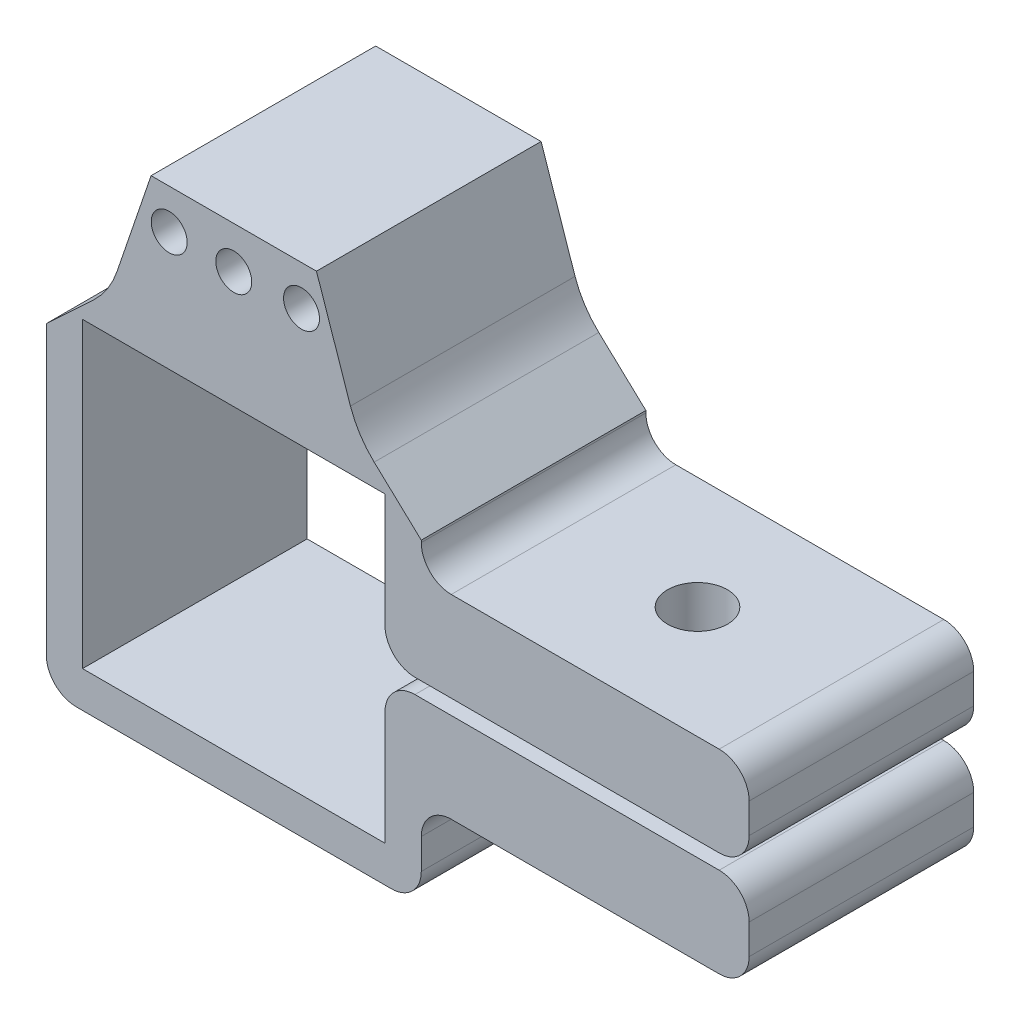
ISO-10303-21;
HEADER;
FILE_DESCRIPTION(('STEP AP214'),'2;1');
FILE_NAME('part.step','',(''),(''),'','','');
FILE_SCHEMA(('AUTOMOTIVE_DESIGN { 1 0 10303 214 1 1 1 1 }'));
ENDSEC;
DATA;
#1=APPLICATION_CONTEXT('core data for automotive mechanical design processes');
#2=APPLICATION_PROTOCOL_DEFINITION('international standard','automotive_design',2000,#1);
#3=PRODUCT_CONTEXT('',#1,'mechanical');
#4=PRODUCT('Part','Part','',(#3));
#5=PRODUCT_RELATED_PRODUCT_CATEGORY('part','',(#4));
#6=PRODUCT_DEFINITION_FORMATION('','',#4);
#7=PRODUCT_DEFINITION_CONTEXT('part definition',#1,'design');
#8=PRODUCT_DEFINITION('design','',#6,#7);
#9=PRODUCT_DEFINITION_SHAPE('','',#8);
#10=(LENGTH_UNIT() NAMED_UNIT(*) SI_UNIT(.MILLI.,.METRE.));
#11=(NAMED_UNIT(*) PLANE_ANGLE_UNIT() SI_UNIT($,.RADIAN.));
#12=(NAMED_UNIT(*) SI_UNIT($,.STERADIAN.) SOLID_ANGLE_UNIT());
#13=UNCERTAINTY_MEASURE_WITH_UNIT(LENGTH_MEASURE(1.E-05),#10,'distance_accuracy_value','');
#14=(GEOMETRIC_REPRESENTATION_CONTEXT(3) GLOBAL_UNCERTAINTY_ASSIGNED_CONTEXT((#13)) GLOBAL_UNIT_ASSIGNED_CONTEXT((#10,
#11,#12)) REPRESENTATION_CONTEXT('',''));
#15=CARTESIAN_POINT('',(0.,0.,0.));
#16=DIRECTION('',(0.,0.,1.));
#17=DIRECTION('',(1.,0.,0.));
#18=AXIS2_PLACEMENT_3D('',#15,#16,#17);
#19=CARTESIAN_POINT('',(-215.242156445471,0.198580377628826,15.));
#20=DIRECTION('',(0.,0.,-1.));
#21=DIRECTION('',(-1.,0.,0.));
#22=AXIS2_PLACEMENT_3D('',#19,#20,#21);
#23=PLANE('',#22);
#24=CARTESIAN_POINT('',(-227.342156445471,20.6077748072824,15.));
#25=DIRECTION('',(0.,0.,1.));
#26=DIRECTION('',(1.,0.,0.));
#27=AXIS2_PLACEMENT_3D('',#24,#25,#26);
#28=CIRCLE('',#27,1.20000000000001);
#29=CARTESIAN_POINT('',(-226.142156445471,20.6077748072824,15.));
#30=VERTEX_POINT('',#29);
#31=EDGE_CURVE('E443',#30,#30,#28,.T.);
#32=ORIENTED_EDGE('',*,*,#31,.F.);
#33=EDGE_LOOP('',(#32));
#34=FACE_BOUND('',#33,.T.);
#35=DIRECTION('',(0.,1.,0.));
#36=VECTOR('',#35,1.);
#37=CARTESIAN_POINT('',(-214.820078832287,16.3958612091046,15.));
#38=LINE('',#37,#36);
#39=CARTESIAN_POINT('',(-214.820078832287,11.1985803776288,15.));
#40=VERTEX_POINT('',#39);
#41=CARTESIAN_POINT('',(-214.820078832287,11.3393773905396,15.));
#42=VERTEX_POINT('',#41);
#43=EDGE_CURVE('E399',#40,#42,#38,.T.);
#44=ORIENTED_EDGE('',*,*,#43,.T.);
#45=DIRECTION('',(0.730787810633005,-0.682604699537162,0.));
#46=VECTOR('',#45,1.);
#47=CARTESIAN_POINT('',(-214.820078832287,11.3393773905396,15.));
#48=LINE('',#47,#46);
#49=CARTESIAN_POINT('',(-217.965212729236,14.2771428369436,15.));
#50=VERTEX_POINT('',#49);
#51=EDGE_CURVE('E500',#50,#42,#48,.T.);
#52=ORIENTED_EDGE('',*,*,#51,.F.);
#53=CARTESIAN_POINT('',(-213.869584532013,18.6618697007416,15.));
#54=DIRECTION('',(0.,0.,1.));
#55=DIRECTION('',(-1.,0.,0.));
#56=AXIS2_PLACEMENT_3D('',#53,#54,#55);
#57=CIRCLE('',#56,6.);
#58=CARTESIAN_POINT('',(-219.549280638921,16.7276897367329,15.));
#59=VERTEX_POINT('',#58);
#60=EDGE_CURVE('E504',#59,#50,#57,.T.);
#61=ORIENTED_EDGE('',*,*,#60,.F.);
#62=DIRECTION('',(0.322363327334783,-0.946616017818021,0.));
#63=VECTOR('',#62,1.);
#64=CARTESIAN_POINT('',(-221.820078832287,23.3958612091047,15.));
#65=LINE('',#64,#63);
#66=CARTESIAN_POINT('',(-221.820078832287,23.3958612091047,15.));
#67=VERTEX_POINT('',#66);
#68=EDGE_CURVE('E507',#67,#59,#65,.T.);
#69=ORIENTED_EDGE('',*,*,#68,.F.);
#70=DIRECTION('',(-1.,0.,0.));
#71=VECTOR('',#70,1.);
#72=CARTESIAN_POINT('',(-232.86399037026,23.3958612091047,15.));
#73=LINE('',#72,#71);
#74=CARTESIAN_POINT('',(-232.86399037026,23.3958612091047,15.));
#75=VERTEX_POINT('',#74);
#76=EDGE_CURVE('E401',#67,#75,#73,.T.);
#77=ORIENTED_EDGE('',*,*,#76,.T.);
#78=DIRECTION('',(0.322363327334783,0.946616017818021,0.));
#79=VECTOR('',#78,1.);
#80=CARTESIAN_POINT('',(-232.86399037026,23.3958612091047,15.));
#81=LINE('',#80,#79);
#82=CARTESIAN_POINT('',(-235.134788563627,16.7276897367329,15.));
#83=VERTEX_POINT('',#82);
#84=EDGE_CURVE('E475',#83,#75,#81,.T.);
#85=ORIENTED_EDGE('',*,*,#84,.F.);
#86=CARTESIAN_POINT('',(-240.814484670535,18.6618697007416,15.));
#87=DIRECTION('',(0.,0.,1.));
#88=DIRECTION('',(1.,0.,0.));
#89=AXIS2_PLACEMENT_3D('',#86,#87,#88);
#90=CIRCLE('',#89,6.);
#91=CARTESIAN_POINT('',(-236.718856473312,14.2771428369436,15.));
#92=VERTEX_POINT('',#91);
#93=EDGE_CURVE('E478',#92,#83,#90,.T.);
#94=ORIENTED_EDGE('',*,*,#93,.F.);
#95=DIRECTION('',(0.730787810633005,0.682604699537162,0.));
#96=VECTOR('',#95,1.);
#97=CARTESIAN_POINT('',(-239.863990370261,11.3393773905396,15.));
#98=LINE('',#97,#96);
#99=CARTESIAN_POINT('',(-239.863990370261,11.3393773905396,15.));
#100=VERTEX_POINT('',#99);
#101=EDGE_CURVE('E481',#100,#92,#98,.T.);
#102=ORIENTED_EDGE('',*,*,#101,.F.);
#103=DIRECTION('',(0.,-1.,0.));
#104=VECTOR('',#103,1.);
#105=CARTESIAN_POINT('',(-239.863990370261,-7.82349589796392,15.));
#106=LINE('',#105,#104);
#107=CARTESIAN_POINT('',(-239.863990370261,-7.82349589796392,15.));
#108=VERTEX_POINT('',#107);
#109=EDGE_CURVE('E404',#100,#108,#106,.T.);
#110=ORIENTED_EDGE('',*,*,#109,.T.);
#111=CARTESIAN_POINT('',(-237.863990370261,-7.82349589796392,15.));
#112=DIRECTION('',(0.,0.,1.));
#113=DIRECTION('',(1.,0.,0.));
#114=AXIS2_PLACEMENT_3D('',#111,#112,#113);
#115=CIRCLE('',#114,2.);
#116=CARTESIAN_POINT('',(-237.863990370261,-9.82349589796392,15.));
#117=VERTEX_POINT('',#116);
#118=EDGE_CURVE('E406',#108,#117,#115,.T.);
#119=ORIENTED_EDGE('',*,*,#118,.T.);
#120=DIRECTION('',(1.,0.,0.));
#121=VECTOR('',#120,1.);
#122=CARTESIAN_POINT('',(-216.820078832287,-9.82349589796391,15.));
#123=LINE('',#122,#121);
#124=CARTESIAN_POINT('',(-216.820078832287,-9.82349589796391,15.));
#125=VERTEX_POINT('',#124);
#126=EDGE_CURVE('E408',#117,#125,#123,.T.);
#127=ORIENTED_EDGE('',*,*,#126,.T.);
#128=CARTESIAN_POINT('',(-216.820078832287,-7.82349589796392,15.));
#129=DIRECTION('',(0.,0.,1.));
#130=DIRECTION('',(1.,0.,0.));
#131=AXIS2_PLACEMENT_3D('',#128,#129,#130);
#132=CIRCLE('',#131,2.);
#133=CARTESIAN_POINT('',(-214.820078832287,-7.82349589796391,15.));
#134=VERTEX_POINT('',#133);
#135=EDGE_CURVE('E410',#125,#134,#132,.T.);
#136=ORIENTED_EDGE('',*,*,#135,.T.);
#137=DIRECTION('',(0.,1.,0.));
#138=VECTOR('',#137,1.);
#139=CARTESIAN_POINT('',(-214.820078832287,-7.82349589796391,15.));
#140=LINE('',#139,#138);
#141=CARTESIAN_POINT('',(-214.820078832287,-5.80141962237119,15.));
#142=VERTEX_POINT('',#141);
#143=EDGE_CURVE('E412',#134,#142,#140,.T.);
#144=ORIENTED_EDGE('',*,*,#143,.T.);
#145=CARTESIAN_POINT('',(-212.820078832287,-5.80141962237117,15.));
#146=DIRECTION('',(0.,0.,-1.));
#147=DIRECTION('',(1.,0.,0.));
#148=AXIS2_PLACEMENT_3D('',#145,#146,#147);
#149=CIRCLE('',#148,2.);
#150=CARTESIAN_POINT('',(-212.820078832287,-3.80141962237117,15.));
#151=VERTEX_POINT('',#150);
#152=EDGE_CURVE('E414',#142,#151,#149,.T.);
#153=ORIENTED_EDGE('',*,*,#152,.T.);
#154=DIRECTION('',(1.,0.,0.));
#155=VECTOR('',#154,1.);
#156=CARTESIAN_POINT('',(-212.820078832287,-3.80141962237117,15.));
#157=LINE('',#156,#155);
#158=CARTESIAN_POINT('',(-194.92581591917,-3.80141962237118,15.));
#159=VERTEX_POINT('',#158);
#160=EDGE_CURVE('E416',#151,#159,#157,.T.);
#161=ORIENTED_EDGE('',*,*,#160,.T.);
#162=CARTESIAN_POINT('',(-194.92581591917,-1.80141962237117,15.));
#163=DIRECTION('',(0.,0.,1.));
#164=DIRECTION('',(1.,0.,0.));
#165=AXIS2_PLACEMENT_3D('',#162,#163,#164);
#166=CIRCLE('',#165,2.);
#167=CARTESIAN_POINT('',(-192.92581591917,-1.80141962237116,15.));
#168=VERTEX_POINT('',#167);
#169=EDGE_CURVE('E418',#159,#168,#166,.T.);
#170=ORIENTED_EDGE('',*,*,#169,.T.);
#171=DIRECTION('',(0.,1.,0.));
#172=VECTOR('',#171,1.);
#173=CARTESIAN_POINT('',(-192.92581591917,-1.80141962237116,15.));
#174=LINE('',#173,#172);
#175=CARTESIAN_POINT('',(-192.92581591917,0.198580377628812,15.));
#176=VERTEX_POINT('',#175);
#177=EDGE_CURVE('E420',#168,#176,#174,.T.);
#178=ORIENTED_EDGE('',*,*,#177,.T.);
#179=CARTESIAN_POINT('',(-194.92581591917,0.198580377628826,15.));
#180=DIRECTION('',(0.,0.,1.));
#181=DIRECTION('',(1.,0.,0.));
#182=AXIS2_PLACEMENT_3D('',#179,#180,#181);
#183=CIRCLE('',#182,2.);
#184=CARTESIAN_POINT('',(-194.92581591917,2.19858037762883,15.));
#185=VERTEX_POINT('',#184);
#186=EDGE_CURVE('E422',#176,#185,#183,.T.);
#187=ORIENTED_EDGE('',*,*,#186,.T.);
#188=DIRECTION('',(-1.,0.,0.));
#189=VECTOR('',#188,1.);
#190=CARTESIAN_POINT('',(-194.92581591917,2.19858037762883,15.));
#191=LINE('',#190,#189);
#192=CARTESIAN_POINT('',(-215.242156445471,2.19858037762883,15.));
#193=VERTEX_POINT('',#192);
#194=EDGE_CURVE('E220',#185,#193,#191,.T.);
#195=ORIENTED_EDGE('',*,*,#194,.T.);
#196=CARTESIAN_POINT('',(-215.242156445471,0.198580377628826,15.));
#197=DIRECTION('',(0.,0.,1.));
#198=DIRECTION('',(-1.,0.,0.));
#199=AXIS2_PLACEMENT_3D('',#196,#197,#198);
#200=CIRCLE('',#199,2.);
#201=CARTESIAN_POINT('',(-217.242156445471,0.198580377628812,15.));
#202=VERTEX_POINT('',#201);
#203=EDGE_CURVE('E212',#193,#202,#200,.T.);
#204=ORIENTED_EDGE('',*,*,#203,.T.);
#205=DIRECTION('',(0.,-1.,0.));
#206=VECTOR('',#205,1.);
#207=CARTESIAN_POINT('',(-217.242156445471,-7.40141962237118,15.));
#208=LINE('',#207,#206);
#209=CARTESIAN_POINT('',(-217.242156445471,-7.40141962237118,15.));
#210=VERTEX_POINT('',#209);
#211=EDGE_CURVE('E217',#202,#210,#208,.T.);
#212=ORIENTED_EDGE('',*,*,#211,.T.);
#213=DIRECTION('',(-1.,0.,0.));
#214=VECTOR('',#213,1.);
#215=CARTESIAN_POINT('',(-237.442156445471,-7.40141962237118,15.));
#216=LINE('',#215,#214);
#217=CARTESIAN_POINT('',(-237.442156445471,-7.40141962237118,15.));
#218=VERTEX_POINT('',#217);
#219=EDGE_CURVE('E56',#210,#218,#216,.T.);
#220=ORIENTED_EDGE('',*,*,#219,.T.);
#221=DIRECTION('',(0.,1.,0.));
#222=VECTOR('',#221,1.);
#223=CARTESIAN_POINT('',(-237.442156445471,12.7985803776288,15.));
#224=LINE('',#223,#222);
#225=CARTESIAN_POINT('',(-237.442156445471,12.7985803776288,15.));
#226=VERTEX_POINT('',#225);
#227=EDGE_CURVE('E295',#218,#226,#224,.T.);
#228=ORIENTED_EDGE('',*,*,#227,.T.);
#229=DIRECTION('',(1.,0.,0.));
#230=VECTOR('',#229,1.);
#231=CARTESIAN_POINT('',(-217.242156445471,12.7985803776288,15.));
#232=LINE('',#231,#230);
#233=CARTESIAN_POINT('',(-217.242156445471,12.7985803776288,15.));
#234=VERTEX_POINT('',#233);
#235=EDGE_CURVE('E148',#226,#234,#232,.T.);
#236=ORIENTED_EDGE('',*,*,#235,.T.);
#237=DIRECTION('',(0.,-1.,0.));
#238=VECTOR('',#237,1.);
#239=CARTESIAN_POINT('',(-217.242156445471,5.19858037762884,15.));
#240=LINE('',#239,#238);
#241=CARTESIAN_POINT('',(-217.242156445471,5.19858037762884,15.));
#242=VERTEX_POINT('',#241);
#243=EDGE_CURVE('E365',#234,#242,#240,.T.);
#244=ORIENTED_EDGE('',*,*,#243,.T.);
#245=CARTESIAN_POINT('',(-215.242156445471,5.19858037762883,15.));
#246=DIRECTION('',(0.,0.,1.));
#247=DIRECTION('',(-1.,0.,0.));
#248=AXIS2_PLACEMENT_3D('',#245,#246,#247);
#249=CIRCLE('',#248,2.);
#250=CARTESIAN_POINT('',(-215.242156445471,3.19858037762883,15.));
#251=VERTEX_POINT('',#250);
#252=EDGE_CURVE('E385',#242,#251,#249,.T.);
#253=ORIENTED_EDGE('',*,*,#252,.T.);
#254=DIRECTION('',(1.,0.,0.));
#255=VECTOR('',#254,1.);
#256=CARTESIAN_POINT('',(-194.92581591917,3.19858037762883,15.));
#257=LINE('',#256,#255);
#258=CARTESIAN_POINT('',(-194.92581591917,3.19858037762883,15.));
#259=VERTEX_POINT('',#258);
#260=EDGE_CURVE('E382',#251,#259,#257,.T.);
#261=ORIENTED_EDGE('',*,*,#260,.T.);
#262=CARTESIAN_POINT('',(-194.92581591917,5.19858037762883,15.));
#263=DIRECTION('',(0.,0.,1.));
#264=DIRECTION('',(-1.,0.,0.));
#265=AXIS2_PLACEMENT_3D('',#262,#263,#264);
#266=CIRCLE('',#265,2.);
#267=CARTESIAN_POINT('',(-192.92581591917,5.19858037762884,15.));
#268=VERTEX_POINT('',#267);
#269=EDGE_CURVE('E384',#259,#268,#266,.T.);
#270=ORIENTED_EDGE('',*,*,#269,.T.);
#271=DIRECTION('',(0.,1.,0.));
#272=VECTOR('',#271,1.);
#273=CARTESIAN_POINT('',(-192.92581591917,7.19858037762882,15.));
#274=LINE('',#273,#272);
#275=CARTESIAN_POINT('',(-192.92581591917,7.19858037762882,15.));
#276=VERTEX_POINT('',#275);
#277=EDGE_CURVE('E387',#268,#276,#274,.T.);
#278=ORIENTED_EDGE('',*,*,#277,.T.);
#279=CARTESIAN_POINT('',(-194.92581591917,7.19858037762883,15.));
#280=DIRECTION('',(0.,0.,1.));
#281=DIRECTION('',(-1.,0.,0.));
#282=AXIS2_PLACEMENT_3D('',#279,#280,#281);
#283=CIRCLE('',#282,2.);
#284=CARTESIAN_POINT('',(-194.92581591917,9.19858037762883,15.));
#285=VERTEX_POINT('',#284);
#286=EDGE_CURVE('E393',#276,#285,#283,.T.);
#287=ORIENTED_EDGE('',*,*,#286,.T.);
#288=DIRECTION('',(-1.,0.,0.));
#289=VECTOR('',#288,1.);
#290=CARTESIAN_POINT('',(-212.820078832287,9.19858037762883,15.));
#291=LINE('',#290,#289);
#292=CARTESIAN_POINT('',(-212.820078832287,9.19858037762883,15.));
#293=VERTEX_POINT('',#292);
#294=EDGE_CURVE('E395',#285,#293,#291,.T.);
#295=ORIENTED_EDGE('',*,*,#294,.T.);
#296=CARTESIAN_POINT('',(-212.820078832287,11.1985803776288,15.));
#297=DIRECTION('',(0.,0.,-1.));
#298=DIRECTION('',(-1.,0.,0.));
#299=AXIS2_PLACEMENT_3D('',#296,#297,#298);
#300=CIRCLE('',#299,2.);
#301=EDGE_CURVE('E397',#293,#40,#300,.T.);
#302=ORIENTED_EDGE('',*,*,#301,.T.);
#303=EDGE_LOOP('',(#44,#52,#61,#69,#77,#85,#94,#102,#110,#119,#127,#136,#144,#153,#161,#170,
#178,#187,#195,#204,#212,#220,#228,#236,#244,#253,#261,#270,#278,#287,#295,#302));
#304=FACE_BOUND('',#303,.T.);
#305=CARTESIAN_POINT('',(-231.654521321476,20.7423191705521,15.));
#306=DIRECTION('',(0.,0.,1.));
#307=DIRECTION('',(1.,0.,0.));
#308=AXIS2_PLACEMENT_3D('',#305,#306,#307);
#309=CIRCLE('',#308,1.20000000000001);
#310=CARTESIAN_POINT('',(-230.454521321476,20.7423191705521,15.));
#311=VERTEX_POINT('',#310);
#312=EDGE_CURVE('E245',#311,#311,#309,.T.);
#313=ORIENTED_EDGE('',*,*,#312,.F.);
#314=EDGE_LOOP('',(#313));
#315=FACE_BOUND('',#314,.T.);
#316=CARTESIAN_POINT('',(-222.817251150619,20.7423191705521,15.));
#317=DIRECTION('',(0.,0.,1.));
#318=DIRECTION('',(1.,0.,0.));
#319=AXIS2_PLACEMENT_3D('',#316,#317,#318);
#320=CIRCLE('',#319,1.20000000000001);
#321=CARTESIAN_POINT('',(-221.617251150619,20.7423191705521,15.));
#322=VERTEX_POINT('',#321);
#323=EDGE_CURVE('E449',#322,#322,#320,.T.);
#324=ORIENTED_EDGE('',*,*,#323,.F.);
#325=EDGE_LOOP('',(#324));
#326=FACE_BOUND('',#325,.T.);
#327=ADVANCED_FACE('F31',(#34,#304,#315,#326),#23,.F.);
#328=CARTESIAN_POINT('',(-215.242156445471,0.198580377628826,0.));
#329=DIRECTION('',(0.,0.,-1.));
#330=DIRECTION('',(-1.,0.,0.));
#331=AXIS2_PLACEMENT_3D('',#328,#329,#330);
#332=PLANE('',#331);
#333=DIRECTION('',(0.730787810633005,-0.682604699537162,0.));
#334=VECTOR('',#333,1.);
#335=CARTESIAN_POINT('',(-214.820078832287,11.3393773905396,0.));
#336=LINE('',#335,#334);
#337=CARTESIAN_POINT('',(-217.965212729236,14.2771428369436,0.));
#338=VERTEX_POINT('',#337);
#339=CARTESIAN_POINT('',(-214.820078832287,11.3393773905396,0.));
#340=VERTEX_POINT('',#339);
#341=EDGE_CURVE('E495',#338,#340,#336,.T.);
#342=ORIENTED_EDGE('',*,*,#341,.T.);
#343=DIRECTION('',(0.,1.,0.));
#344=VECTOR('',#343,1.);
#345=CARTESIAN_POINT('',(-214.820078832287,16.3958612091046,0.));
#346=LINE('',#345,#344);
#347=CARTESIAN_POINT('',(-214.820078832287,11.1985803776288,0.));
#348=VERTEX_POINT('',#347);
#349=EDGE_CURVE('E263',#348,#340,#346,.T.);
#350=ORIENTED_EDGE('',*,*,#349,.F.);
#351=CARTESIAN_POINT('',(-212.820078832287,11.1985803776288,0.));
#352=DIRECTION('',(0.,0.,-1.));
#353=DIRECTION('',(-1.,0.,0.));
#354=AXIS2_PLACEMENT_3D('',#351,#352,#353);
#355=CIRCLE('',#354,2.);
#356=CARTESIAN_POINT('',(-212.820078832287,9.19858037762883,0.));
#357=VERTEX_POINT('',#356);
#358=EDGE_CURVE('E261',#357,#348,#355,.T.);
#359=ORIENTED_EDGE('',*,*,#358,.F.);
#360=DIRECTION('',(-1.,0.,0.));
#361=VECTOR('',#360,1.);
#362=CARTESIAN_POINT('',(-212.820078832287,9.19858037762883,0.));
#363=LINE('',#362,#361);
#364=CARTESIAN_POINT('',(-194.92581591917,9.19858037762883,0.));
#365=VERTEX_POINT('',#364);
#366=EDGE_CURVE('E259',#365,#357,#363,.T.);
#367=ORIENTED_EDGE('',*,*,#366,.F.);
#368=CARTESIAN_POINT('',(-194.92581591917,7.19858037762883,0.));
#369=DIRECTION('',(0.,0.,1.));
#370=DIRECTION('',(-1.,0.,0.));
#371=AXIS2_PLACEMENT_3D('',#368,#369,#370);
#372=CIRCLE('',#371,2.);
#373=CARTESIAN_POINT('',(-192.92581591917,7.19858037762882,0.));
#374=VERTEX_POINT('',#373);
#375=EDGE_CURVE('E257',#374,#365,#372,.T.);
#376=ORIENTED_EDGE('',*,*,#375,.F.);
#377=DIRECTION('',(0.,1.,0.));
#378=VECTOR('',#377,1.);
#379=CARTESIAN_POINT('',(-192.92581591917,7.19858037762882,0.));
#380=LINE('',#379,#378);
#381=CARTESIAN_POINT('',(-192.92581591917,5.19858037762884,0.));
#382=VERTEX_POINT('',#381);
#383=EDGE_CURVE('E255',#382,#374,#380,.T.);
#384=ORIENTED_EDGE('',*,*,#383,.F.);
#385=CARTESIAN_POINT('',(-194.92581591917,5.19858037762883,0.));
#386=DIRECTION('',(0.,0.,1.));
#387=DIRECTION('',(-1.,0.,0.));
#388=AXIS2_PLACEMENT_3D('',#385,#386,#387);
#389=CIRCLE('',#388,2.);
#390=CARTESIAN_POINT('',(-194.92581591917,3.19858037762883,0.));
#391=VERTEX_POINT('',#390);
#392=EDGE_CURVE('E253',#391,#382,#389,.T.);
#393=ORIENTED_EDGE('',*,*,#392,.F.);
#394=DIRECTION('',(1.,0.,0.));
#395=VECTOR('',#394,1.);
#396=CARTESIAN_POINT('',(-194.92581591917,3.19858037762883,0.));
#397=LINE('',#396,#395);
#398=CARTESIAN_POINT('',(-215.242156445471,3.19858037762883,0.));
#399=VERTEX_POINT('',#398);
#400=EDGE_CURVE('E251',#399,#391,#397,.T.);
#401=ORIENTED_EDGE('',*,*,#400,.F.);
#402=CARTESIAN_POINT('',(-215.242156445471,5.19858037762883,0.));
#403=DIRECTION('',(0.,0.,1.));
#404=DIRECTION('',(-1.,0.,0.));
#405=AXIS2_PLACEMENT_3D('',#402,#403,#404);
#406=CIRCLE('',#405,2.);
#407=CARTESIAN_POINT('',(-217.242156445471,5.19858037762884,0.));
#408=VERTEX_POINT('',#407);
#409=EDGE_CURVE('E249',#408,#399,#406,.T.);
#410=ORIENTED_EDGE('',*,*,#409,.F.);
#411=DIRECTION('',(0.,-1.,0.));
#412=VECTOR('',#411,1.);
#413=CARTESIAN_POINT('',(-217.242156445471,5.19858037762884,0.));
#414=LINE('',#413,#412);
#415=CARTESIAN_POINT('',(-217.242156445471,12.7985803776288,0.));
#416=VERTEX_POINT('',#415);
#417=EDGE_CURVE('E247',#416,#408,#414,.T.);
#418=ORIENTED_EDGE('',*,*,#417,.F.);
#419=DIRECTION('',(1.,0.,0.));
#420=VECTOR('',#419,1.);
#421=CARTESIAN_POINT('',(-217.242156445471,12.7985803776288,0.));
#422=LINE('',#421,#420);
#423=CARTESIAN_POINT('',(-237.442156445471,12.7985803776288,0.));
#424=VERTEX_POINT('',#423);
#425=EDGE_CURVE('E244',#424,#416,#422,.T.);
#426=ORIENTED_EDGE('',*,*,#425,.F.);
#427=DIRECTION('',(0.,1.,0.));
#428=VECTOR('',#427,1.);
#429=CARTESIAN_POINT('',(-237.442156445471,12.7985803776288,0.));
#430=LINE('',#429,#428);
#431=CARTESIAN_POINT('',(-237.442156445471,-7.40141962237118,0.));
#432=VERTEX_POINT('',#431);
#433=EDGE_CURVE('E241',#432,#424,#430,.T.);
#434=ORIENTED_EDGE('',*,*,#433,.F.);
#435=DIRECTION('',(-1.,0.,0.));
#436=VECTOR('',#435,1.);
#437=CARTESIAN_POINT('',(-237.442156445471,-7.40141962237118,0.));
#438=LINE('',#437,#436);
#439=CARTESIAN_POINT('',(-217.242156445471,-7.40141962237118,0.));
#440=VERTEX_POINT('',#439);
#441=EDGE_CURVE('E140',#440,#432,#438,.T.);
#442=ORIENTED_EDGE('',*,*,#441,.F.);
#443=DIRECTION('',(0.,-1.,0.));
#444=VECTOR('',#443,1.);
#445=CARTESIAN_POINT('',(-217.242156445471,-7.40141962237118,0.));
#446=LINE('',#445,#444);
#447=CARTESIAN_POINT('',(-217.242156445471,0.198580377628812,0.));
#448=VERTEX_POINT('',#447);
#449=EDGE_CURVE('E292',#448,#440,#446,.T.);
#450=ORIENTED_EDGE('',*,*,#449,.F.);
#451=CARTESIAN_POINT('',(-215.242156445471,0.198580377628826,0.));
#452=DIRECTION('',(0.,0.,1.));
#453=DIRECTION('',(-1.,0.,0.));
#454=AXIS2_PLACEMENT_3D('',#451,#452,#453);
#455=CIRCLE('',#454,2.);
#456=CARTESIAN_POINT('',(-215.242156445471,2.19858037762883,0.));
#457=VERTEX_POINT('',#456);
#458=EDGE_CURVE('E229',#457,#448,#455,.T.);
#459=ORIENTED_EDGE('',*,*,#458,.F.);
#460=DIRECTION('',(-1.,0.,0.));
#461=VECTOR('',#460,1.);
#462=CARTESIAN_POINT('',(-194.92581591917,2.19858037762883,0.));
#463=LINE('',#462,#461);
#464=CARTESIAN_POINT('',(-194.92581591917,2.19858037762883,0.));
#465=VERTEX_POINT('',#464);
#466=EDGE_CURVE('E289',#465,#457,#463,.T.);
#467=ORIENTED_EDGE('',*,*,#466,.F.);
#468=CARTESIAN_POINT('',(-194.92581591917,0.198580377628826,0.));
#469=DIRECTION('',(0.,0.,1.));
#470=DIRECTION('',(1.,0.,0.));
#471=AXIS2_PLACEMENT_3D('',#468,#469,#470);
#472=CIRCLE('',#471,2.);
#473=CARTESIAN_POINT('',(-192.92581591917,0.198580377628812,0.));
#474=VERTEX_POINT('',#473);
#475=EDGE_CURVE('E287',#474,#465,#472,.T.);
#476=ORIENTED_EDGE('',*,*,#475,.F.);
#477=DIRECTION('',(0.,1.,0.));
#478=VECTOR('',#477,1.);
#479=CARTESIAN_POINT('',(-192.92581591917,-1.80141962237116,0.));
#480=LINE('',#479,#478);
#481=CARTESIAN_POINT('',(-192.92581591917,-1.80141962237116,0.));
#482=VERTEX_POINT('',#481);
#483=EDGE_CURVE('E285',#482,#474,#480,.T.);
#484=ORIENTED_EDGE('',*,*,#483,.F.);
#485=CARTESIAN_POINT('',(-194.92581591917,-1.80141962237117,0.));
#486=DIRECTION('',(0.,0.,1.));
#487=DIRECTION('',(1.,0.,0.));
#488=AXIS2_PLACEMENT_3D('',#485,#486,#487);
#489=CIRCLE('',#488,2.);
#490=CARTESIAN_POINT('',(-194.92581591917,-3.80141962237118,0.));
#491=VERTEX_POINT('',#490);
#492=EDGE_CURVE('E283',#491,#482,#489,.T.);
#493=ORIENTED_EDGE('',*,*,#492,.F.);
#494=DIRECTION('',(1.,0.,0.));
#495=VECTOR('',#494,1.);
#496=CARTESIAN_POINT('',(-212.820078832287,-3.80141962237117,0.));
#497=LINE('',#496,#495);
#498=CARTESIAN_POINT('',(-212.820078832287,-3.80141962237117,0.));
#499=VERTEX_POINT('',#498);
#500=EDGE_CURVE('E281',#499,#491,#497,.T.);
#501=ORIENTED_EDGE('',*,*,#500,.F.);
#502=CARTESIAN_POINT('',(-212.820078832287,-5.80141962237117,0.));
#503=DIRECTION('',(0.,0.,-1.));
#504=DIRECTION('',(1.,0.,0.));
#505=AXIS2_PLACEMENT_3D('',#502,#503,#504);
#506=CIRCLE('',#505,2.);
#507=CARTESIAN_POINT('',(-214.820078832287,-5.80141962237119,0.));
#508=VERTEX_POINT('',#507);
#509=EDGE_CURVE('E279',#508,#499,#506,.T.);
#510=ORIENTED_EDGE('',*,*,#509,.F.);
#511=DIRECTION('',(0.,1.,0.));
#512=VECTOR('',#511,1.);
#513=CARTESIAN_POINT('',(-214.820078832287,-7.82349589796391,0.));
#514=LINE('',#513,#512);
#515=CARTESIAN_POINT('',(-214.820078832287,-7.82349589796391,0.));
#516=VERTEX_POINT('',#515);
#517=EDGE_CURVE('E277',#516,#508,#514,.T.);
#518=ORIENTED_EDGE('',*,*,#517,.F.);
#519=CARTESIAN_POINT('',(-216.820078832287,-7.82349589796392,0.));
#520=DIRECTION('',(0.,0.,1.));
#521=DIRECTION('',(1.,0.,0.));
#522=AXIS2_PLACEMENT_3D('',#519,#520,#521);
#523=CIRCLE('',#522,2.);
#524=CARTESIAN_POINT('',(-216.820078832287,-9.82349589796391,0.));
#525=VERTEX_POINT('',#524);
#526=EDGE_CURVE('E275',#525,#516,#523,.T.);
#527=ORIENTED_EDGE('',*,*,#526,.F.);
#528=DIRECTION('',(1.,0.,0.));
#529=VECTOR('',#528,1.);
#530=CARTESIAN_POINT('',(-216.820078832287,-9.82349589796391,0.));
#531=LINE('',#530,#529);
#532=CARTESIAN_POINT('',(-237.863990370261,-9.82349589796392,0.));
#533=VERTEX_POINT('',#532);
#534=EDGE_CURVE('E273',#533,#525,#531,.T.);
#535=ORIENTED_EDGE('',*,*,#534,.F.);
#536=CARTESIAN_POINT('',(-237.863990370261,-7.82349589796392,0.));
#537=DIRECTION('',(0.,0.,1.));
#538=DIRECTION('',(1.,0.,0.));
#539=AXIS2_PLACEMENT_3D('',#536,#537,#538);
#540=CIRCLE('',#539,2.);
#541=CARTESIAN_POINT('',(-239.863990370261,-7.82349589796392,0.));
#542=VERTEX_POINT('',#541);
#543=EDGE_CURVE('E271',#542,#533,#540,.T.);
#544=ORIENTED_EDGE('',*,*,#543,.F.);
#545=DIRECTION('',(0.,-1.,0.));
#546=VECTOR('',#545,1.);
#547=CARTESIAN_POINT('',(-239.863990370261,-7.82349589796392,0.));
#548=LINE('',#547,#546);
#549=CARTESIAN_POINT('',(-239.863990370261,11.3393773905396,0.));
#550=VERTEX_POINT('',#549);
#551=EDGE_CURVE('E269',#550,#542,#548,.T.);
#552=ORIENTED_EDGE('',*,*,#551,.F.);
#553=DIRECTION('',(0.730787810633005,0.682604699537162,0.));
#554=VECTOR('',#553,1.);
#555=CARTESIAN_POINT('',(-239.863990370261,11.3393773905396,0.));
#556=LINE('',#555,#554);
#557=CARTESIAN_POINT('',(-236.718856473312,14.2771428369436,0.));
#558=VERTEX_POINT('',#557);
#559=EDGE_CURVE('E47',#550,#558,#556,.T.);
#560=ORIENTED_EDGE('',*,*,#559,.T.);
#561=CARTESIAN_POINT('',(-240.814484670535,18.6618697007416,0.));
#562=DIRECTION('',(0.,0.,1.));
#563=DIRECTION('',(1.,0.,0.));
#564=AXIS2_PLACEMENT_3D('',#561,#562,#563);
#565=CIRCLE('',#564,6.);
#566=CARTESIAN_POINT('',(-235.134788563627,16.7276897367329,0.));
#567=VERTEX_POINT('',#566);
#568=EDGE_CURVE('E487',#558,#567,#565,.T.);
#569=ORIENTED_EDGE('',*,*,#568,.T.);
#570=DIRECTION('',(0.322363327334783,0.946616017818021,0.));
#571=VECTOR('',#570,1.);
#572=CARTESIAN_POINT('',(-232.86399037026,23.3958612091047,0.));
#573=LINE('',#572,#571);
#574=CARTESIAN_POINT('',(-232.86399037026,23.3958612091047,0.));
#575=VERTEX_POINT('',#574);
#576=EDGE_CURVE('E470',#567,#575,#573,.T.);
#577=ORIENTED_EDGE('',*,*,#576,.T.);
#578=DIRECTION('',(-1.,0.,0.));
#579=VECTOR('',#578,1.);
#580=CARTESIAN_POINT('',(-232.86399037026,23.3958612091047,0.));
#581=LINE('',#580,#579);
#582=CARTESIAN_POINT('',(-221.820078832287,23.3958612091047,0.));
#583=VERTEX_POINT('',#582);
#584=EDGE_CURVE('E266',#583,#575,#581,.T.);
#585=ORIENTED_EDGE('',*,*,#584,.F.);
#586=DIRECTION('',(0.322363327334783,-0.946616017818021,0.));
#587=VECTOR('',#586,1.);
#588=CARTESIAN_POINT('',(-221.820078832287,23.3958612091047,0.));
#589=LINE('',#588,#587);
#590=CARTESIAN_POINT('',(-219.549280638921,16.7276897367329,0.));
#591=VERTEX_POINT('',#590);
#592=EDGE_CURVE('E503',#583,#591,#589,.T.);
#593=ORIENTED_EDGE('',*,*,#592,.T.);
#594=CARTESIAN_POINT('',(-213.869584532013,18.6618697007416,0.));
#595=DIRECTION('',(0.,0.,1.));
#596=DIRECTION('',(-1.,0.,0.));
#597=AXIS2_PLACEMENT_3D('',#594,#595,#596);
#598=CIRCLE('',#597,6.);
#599=EDGE_CURVE('E511',#591,#338,#598,.T.);
#600=ORIENTED_EDGE('',*,*,#599,.T.);
#601=EDGE_LOOP('',(#342,#350,#359,#367,#376,#384,#393,#401,#410,#418,#426,#434,#442,#450,#459,
#467,#476,#484,#493,#501,#510,#518,#527,#535,#544,#552,#560,#569,#577,#585,#593,#600));
#602=FACE_BOUND('',#601,.T.);
#603=CARTESIAN_POINT('',(-227.342156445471,20.6077748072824,0.));
#604=DIRECTION('',(0.,0.,1.));
#605=DIRECTION('',(1.,0.,0.));
#606=AXIS2_PLACEMENT_3D('',#603,#604,#605);
#607=CIRCLE('',#606,1.20000000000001);
#608=CARTESIAN_POINT('',(-226.142156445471,20.6077748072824,0.));
#609=VERTEX_POINT('',#608);
#610=EDGE_CURVE('E446',#609,#609,#607,.T.);
#611=ORIENTED_EDGE('',*,*,#610,.T.);
#612=EDGE_LOOP('',(#611));
#613=FACE_BOUND('',#612,.T.);
#614=CARTESIAN_POINT('',(-231.654521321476,20.7423191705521,0.));
#615=DIRECTION('',(0.,0.,1.));
#616=DIRECTION('',(1.,0.,0.));
#617=AXIS2_PLACEMENT_3D('',#614,#615,#616);
#618=CIRCLE('',#617,1.20000000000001);
#619=CARTESIAN_POINT('',(-230.454521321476,20.7423191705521,0.));
#620=VERTEX_POINT('',#619);
#621=EDGE_CURVE('E440',#620,#620,#618,.T.);
#622=ORIENTED_EDGE('',*,*,#621,.T.);
#623=EDGE_LOOP('',(#622));
#624=FACE_BOUND('',#623,.T.);
#625=CARTESIAN_POINT('',(-222.817251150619,20.7423191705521,0.));
#626=DIRECTION('',(0.,0.,1.));
#627=DIRECTION('',(1.,0.,0.));
#628=AXIS2_PLACEMENT_3D('',#625,#626,#627);
#629=CIRCLE('',#628,1.20000000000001);
#630=CARTESIAN_POINT('',(-221.617251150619,20.7423191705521,0.));
#631=VERTEX_POINT('',#630);
#632=EDGE_CURVE('E452',#631,#631,#629,.T.);
#633=ORIENTED_EDGE('',*,*,#632,.T.);
#634=EDGE_LOOP('',(#633));
#635=FACE_BOUND('',#634,.T.);
#636=ADVANCED_FACE('F369',(#602,#613,#624,#635),#332,.T.);
#637=CARTESIAN_POINT('',(-237.442156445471,12.7985803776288,15.));
#638=DIRECTION('',(-1.,0.,0.));
#639=DIRECTION('',(0.,0.,1.));
#640=AXIS2_PLACEMENT_3D('',#637,#638,#639);
#641=PLANE('',#640);
#642=ORIENTED_EDGE('',*,*,#433,.T.);
#643=DIRECTION('',(0.,0.,-1.));
#644=VECTOR('',#643,1.);
#645=CARTESIAN_POINT('',(-237.442156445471,12.7985803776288,15.));
#646=LINE('',#645,#644);
#647=EDGE_CURVE('E11',#226,#424,#646,.T.);
#648=ORIENTED_EDGE('',*,*,#647,.F.);
#649=ORIENTED_EDGE('',*,*,#227,.F.);
#650=DIRECTION('',(0.,0.,-1.));
#651=VECTOR('',#650,1.);
#652=CARTESIAN_POINT('',(-237.442156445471,-7.40141962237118,15.));
#653=LINE('',#652,#651);
#654=EDGE_CURVE('E237',#218,#432,#653,.T.);
#655=ORIENTED_EDGE('',*,*,#654,.T.);
#656=EDGE_LOOP('',(#642,#648,#649,#655));
#657=FACE_BOUND('',#656,.T.);
#658=ADVANCED_FACE('F33',(#657),#641,.F.);
#659=CARTESIAN_POINT('',(-217.242156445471,12.7985803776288,15.));
#660=DIRECTION('',(0.,1.,0.));
#661=DIRECTION('',(-1.,0.,0.));
#662=AXIS2_PLACEMENT_3D('',#659,#660,#661);
#663=PLANE('',#662);
#664=ORIENTED_EDGE('',*,*,#425,.T.);
#665=DIRECTION('',(0.,0.,-1.));
#666=VECTOR('',#665,1.);
#667=CARTESIAN_POINT('',(-217.242156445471,12.7985803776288,15.));
#668=LINE('',#667,#666);
#669=EDGE_CURVE('E40',#234,#416,#668,.T.);
#670=ORIENTED_EDGE('',*,*,#669,.F.);
#671=ORIENTED_EDGE('',*,*,#235,.F.);
#672=ORIENTED_EDGE('',*,*,#647,.T.);
#673=EDGE_LOOP('',(#664,#670,#671,#672));
#674=FACE_BOUND('',#673,.T.);
#675=ADVANCED_FACE('F910',(#674),#663,.F.);
#676=CARTESIAN_POINT('',(-217.242156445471,5.19858037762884,15.));
#677=DIRECTION('',(1.,0.,0.));
#678=DIRECTION('',(0.,0.,-1.));
#679=AXIS2_PLACEMENT_3D('',#676,#677,#678);
#680=PLANE('',#679);
#681=ORIENTED_EDGE('',*,*,#417,.T.);
#682=DIRECTION('',(0.,0.,-1.));
#683=VECTOR('',#682,1.);
#684=CARTESIAN_POINT('',(-217.242156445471,5.19858037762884,15.));
#685=LINE('',#684,#683);
#686=EDGE_CURVE('E356',#242,#408,#685,.T.);
#687=ORIENTED_EDGE('',*,*,#686,.F.);
#688=ORIENTED_EDGE('',*,*,#243,.F.);
#689=ORIENTED_EDGE('',*,*,#669,.T.);
#690=EDGE_LOOP('',(#681,#687,#688,#689));
#691=FACE_BOUND('',#690,.T.);
#692=ADVANCED_FACE('F363',(#691),#680,.F.);
#693=CARTESIAN_POINT('',(-215.242156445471,5.19858037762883,15.));
#694=DIRECTION('',(0.,0.,-1.));
#695=DIRECTION('',(-1.,0.,0.));
#696=AXIS2_PLACEMENT_3D('',#693,#694,#695);
#697=CYLINDRICAL_SURFACE('',#696,2.);
#698=ORIENTED_EDGE('',*,*,#409,.T.);
#699=DIRECTION('',(0.,0.,-1.));
#700=VECTOR('',#699,1.);
#701=CARTESIAN_POINT('',(-215.242156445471,3.19858037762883,15.));
#702=LINE('',#701,#700);
#703=EDGE_CURVE('E353',#251,#399,#702,.T.);
#704=ORIENTED_EDGE('',*,*,#703,.F.);
#705=ORIENTED_EDGE('',*,*,#252,.F.);
#706=ORIENTED_EDGE('',*,*,#686,.T.);
#707=EDGE_LOOP('',(#698,#704,#705,#706));
#708=FACE_BOUND('',#707,.T.);
#709=ADVANCED_FACE('F376',(#708),#697,.T.);
#710=CARTESIAN_POINT('',(-194.92581591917,3.19858037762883,15.));
#711=DIRECTION('',(0.,1.,0.));
#712=DIRECTION('',(0.,0.,1.));
#713=AXIS2_PLACEMENT_3D('',#710,#711,#712);
#714=PLANE('',#713);
#715=CARTESIAN_POINT('',(-203.872947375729,3.19858037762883,7.5));
#716=DIRECTION('',(0.,1.,0.));
#717=DIRECTION('',(0.,0.,1.));
#718=AXIS2_PLACEMENT_3D('',#715,#716,#717);
#719=CIRCLE('',#718,2.);
#720=CARTESIAN_POINT('',(-203.872947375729,3.19858037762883,9.5));
#721=VERTEX_POINT('',#720);
#722=EDGE_CURVE('E455',#721,#721,#719,.T.);
#723=ORIENTED_EDGE('',*,*,#722,.T.);
#724=EDGE_LOOP('',(#723));
#725=FACE_BOUND('',#724,.T.);
#726=ORIENTED_EDGE('',*,*,#400,.T.);
#727=DIRECTION('',(0.,0.,-1.));
#728=VECTOR('',#727,1.);
#729=CARTESIAN_POINT('',(-194.92581591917,3.19858037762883,15.));
#730=LINE('',#729,#728);
#731=EDGE_CURVE('E350',#259,#391,#730,.T.);
#732=ORIENTED_EDGE('',*,*,#731,.F.);
#733=ORIENTED_EDGE('',*,*,#260,.F.);
#734=ORIENTED_EDGE('',*,*,#703,.T.);
#735=EDGE_LOOP('',(#726,#732,#733,#734));
#736=FACE_BOUND('',#735,.T.);
#737=ADVANCED_FACE('F380',(#725,#736),#714,.F.);
#738=CARTESIAN_POINT('',(-194.92581591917,5.19858037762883,15.));
#739=DIRECTION('',(0.,0.,-1.));
#740=DIRECTION('',(-1.,0.,0.));
#741=AXIS2_PLACEMENT_3D('',#738,#739,#740);
#742=CYLINDRICAL_SURFACE('',#741,2.);
#743=ORIENTED_EDGE('',*,*,#392,.T.);
#744=DIRECTION('',(0.,0.,-1.));
#745=VECTOR('',#744,1.);
#746=CARTESIAN_POINT('',(-192.92581591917,5.19858037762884,15.));
#747=LINE('',#746,#745);
#748=EDGE_CURVE('E347',#268,#382,#747,.T.);
#749=ORIENTED_EDGE('',*,*,#748,.F.);
#750=ORIENTED_EDGE('',*,*,#269,.F.);
#751=ORIENTED_EDGE('',*,*,#731,.T.);
#752=EDGE_LOOP('',(#743,#749,#750,#751));
#753=FACE_BOUND('',#752,.T.);
#754=ADVANCED_FACE('F590',(#753),#742,.T.);
#755=CARTESIAN_POINT('',(-192.92581591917,7.19858037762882,15.));
#756=DIRECTION('',(-1.,0.,0.));
#757=DIRECTION('',(0.,0.,1.));
#758=AXIS2_PLACEMENT_3D('',#755,#756,#757);
#759=PLANE('',#758);
#760=ORIENTED_EDGE('',*,*,#383,.T.);
#761=DIRECTION('',(0.,0.,-1.));
#762=VECTOR('',#761,1.);
#763=CARTESIAN_POINT('',(-192.92581591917,7.19858037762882,15.));
#764=LINE('',#763,#762);
#765=EDGE_CURVE('E344',#276,#374,#764,.T.);
#766=ORIENTED_EDGE('',*,*,#765,.F.);
#767=ORIENTED_EDGE('',*,*,#277,.F.);
#768=ORIENTED_EDGE('',*,*,#748,.T.);
#769=EDGE_LOOP('',(#760,#766,#767,#768));
#770=FACE_BOUND('',#769,.T.);
#771=ADVANCED_FACE('F587',(#770),#759,.F.);
#772=CARTESIAN_POINT('',(-194.92581591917,7.19858037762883,15.));
#773=DIRECTION('',(0.,0.,-1.));
#774=DIRECTION('',(-1.,0.,0.));
#775=AXIS2_PLACEMENT_3D('',#772,#773,#774);
#776=CYLINDRICAL_SURFACE('',#775,2.);
#777=ORIENTED_EDGE('',*,*,#375,.T.);
#778=DIRECTION('',(0.,0.,-1.));
#779=VECTOR('',#778,1.);
#780=CARTESIAN_POINT('',(-194.92581591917,9.19858037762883,15.));
#781=LINE('',#780,#779);
#782=EDGE_CURVE('E341',#285,#365,#781,.T.);
#783=ORIENTED_EDGE('',*,*,#782,.F.);
#784=ORIENTED_EDGE('',*,*,#286,.F.);
#785=ORIENTED_EDGE('',*,*,#765,.T.);
#786=EDGE_LOOP('',(#777,#783,#784,#785));
#787=FACE_BOUND('',#786,.T.);
#788=ADVANCED_FACE('F583',(#787),#776,.T.);
#789=CARTESIAN_POINT('',(-212.820078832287,9.19858037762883,15.));
#790=DIRECTION('',(0.,-1.,0.));
#791=DIRECTION('',(0.,0.,-1.));
#792=AXIS2_PLACEMENT_3D('',#789,#790,#791);
#793=PLANE('',#792);
#794=CARTESIAN_POINT('',(-203.872947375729,9.19858037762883,7.5));
#795=DIRECTION('',(0.,1.,0.));
#796=DIRECTION('',(0.,0.,1.));
#797=AXIS2_PLACEMENT_3D('',#794,#795,#796);
#798=CIRCLE('',#797,2.);
#799=CARTESIAN_POINT('',(-203.872947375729,9.19858037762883,9.5));
#800=VERTEX_POINT('',#799);
#801=EDGE_CURVE('E463',#800,#800,#798,.T.);
#802=ORIENTED_EDGE('',*,*,#801,.F.);
#803=EDGE_LOOP('',(#802));
#804=FACE_BOUND('',#803,.T.);
#805=ORIENTED_EDGE('',*,*,#366,.T.);
#806=DIRECTION('',(0.,0.,-1.));
#807=VECTOR('',#806,1.);
#808=CARTESIAN_POINT('',(-212.820078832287,9.19858037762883,15.));
#809=LINE('',#808,#807);
#810=EDGE_CURVE('E338',#293,#357,#809,.T.);
#811=ORIENTED_EDGE('',*,*,#810,.F.);
#812=ORIENTED_EDGE('',*,*,#294,.F.);
#813=ORIENTED_EDGE('',*,*,#782,.T.);
#814=EDGE_LOOP('',(#805,#811,#812,#813));
#815=FACE_BOUND('',#814,.T.);
#816=ADVANCED_FACE('F578',(#804,#815),#793,.F.);
#817=CARTESIAN_POINT('',(-212.820078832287,11.1985803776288,15.));
#818=DIRECTION('',(0.,0.,-1.));
#819=DIRECTION('',(-1.,0.,0.));
#820=AXIS2_PLACEMENT_3D('',#817,#818,#819);
#821=CYLINDRICAL_SURFACE('',#820,2.);
#822=ORIENTED_EDGE('',*,*,#358,.T.);
#823=DIRECTION('',(0.,0.,-1.));
#824=VECTOR('',#823,1.);
#825=CARTESIAN_POINT('',(-214.820078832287,11.1985803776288,15.));
#826=LINE('',#825,#824);
#827=EDGE_CURVE('E335',#40,#348,#826,.T.);
#828=ORIENTED_EDGE('',*,*,#827,.F.);
#829=ORIENTED_EDGE('',*,*,#301,.F.);
#830=ORIENTED_EDGE('',*,*,#810,.T.);
#831=EDGE_LOOP('',(#822,#828,#829,#830));
#832=FACE_BOUND('',#831,.T.);
#833=ADVANCED_FACE('F572',(#832),#821,.F.);
#834=CARTESIAN_POINT('',(-214.820078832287,16.3958612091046,15.));
#835=DIRECTION('',(-1.,0.,0.));
#836=DIRECTION('',(0.,0.,1.));
#837=AXIS2_PLACEMENT_3D('',#834,#835,#836);
#838=PLANE('',#837);
#839=ORIENTED_EDGE('',*,*,#349,.T.);
#840=DIRECTION('',(0.,0.,1.));
#841=VECTOR('',#840,1.);
#842=CARTESIAN_POINT('',(-214.820078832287,11.3393773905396,0.));
#843=LINE('',#842,#841);
#844=EDGE_CURVE('E484',#340,#42,#843,.T.);
#845=ORIENTED_EDGE('',*,*,#844,.T.);
#846=ORIENTED_EDGE('',*,*,#43,.F.);
#847=ORIENTED_EDGE('',*,*,#827,.T.);
#848=EDGE_LOOP('',(#839,#845,#846,#847));
#849=FACE_BOUND('',#848,.T.);
#850=ADVANCED_FACE('F567',(#849),#838,.F.);
#851=CARTESIAN_POINT('',(-232.86399037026,23.3958612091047,15.));
#852=DIRECTION('',(0.,-1.,0.));
#853=DIRECTION('',(1.,0.,0.));
#854=AXIS2_PLACEMENT_3D('',#851,#852,#853);
#855=PLANE('',#854);
#856=ORIENTED_EDGE('',*,*,#584,.T.);
#857=DIRECTION('',(0.,0.,-1.));
#858=VECTOR('',#857,1.);
#859=CARTESIAN_POINT('',(-232.86399037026,23.3958612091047,15.));
#860=LINE('',#859,#858);
#861=EDGE_CURVE('E329',#75,#575,#860,.T.);
#862=ORIENTED_EDGE('',*,*,#861,.F.);
#863=ORIENTED_EDGE('',*,*,#76,.F.);
#864=DIRECTION('',(0.,0.,-1.));
#865=VECTOR('',#864,1.);
#866=CARTESIAN_POINT('',(-221.820078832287,23.3958612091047,15.));
#867=LINE('',#866,#865);
#868=EDGE_CURVE('E332',#67,#583,#867,.T.);
#869=ORIENTED_EDGE('',*,*,#868,.T.);
#870=EDGE_LOOP('',(#856,#862,#863,#869));
#871=FACE_BOUND('',#870,.T.);
#872=ADVANCED_FACE('F529',(#871),#855,.F.);
#873=CARTESIAN_POINT('',(-239.863990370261,-7.82349589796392,15.));
#874=DIRECTION('',(1.,0.,0.));
#875=DIRECTION('',(0.,0.,-1.));
#876=AXIS2_PLACEMENT_3D('',#873,#874,#875);
#877=PLANE('',#876);
#878=ORIENTED_EDGE('',*,*,#109,.F.);
#879=DIRECTION('',(0.,0.,1.));
#880=VECTOR('',#879,1.);
#881=CARTESIAN_POINT('',(-239.863990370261,11.3393773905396,0.));
#882=LINE('',#881,#880);
#883=EDGE_CURVE('E467',#550,#100,#882,.T.);
#884=ORIENTED_EDGE('',*,*,#883,.F.);
#885=ORIENTED_EDGE('',*,*,#551,.T.);
#886=DIRECTION('',(0.,0.,-1.));
#887=VECTOR('',#886,1.);
#888=CARTESIAN_POINT('',(-239.863990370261,-7.82349589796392,15.));
#889=LINE('',#888,#887);
#890=EDGE_CURVE('E326',#108,#542,#889,.T.);
#891=ORIENTED_EDGE('',*,*,#890,.F.);
#892=EDGE_LOOP('',(#878,#884,#885,#891));
#893=FACE_BOUND('',#892,.T.);
#894=ADVANCED_FACE('F654',(#893),#877,.F.);
#895=CARTESIAN_POINT('',(-237.863990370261,-7.82349589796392,15.));
#896=DIRECTION('',(0.,0.,-1.));
#897=DIRECTION('',(-1.,0.,0.));
#898=AXIS2_PLACEMENT_3D('',#895,#896,#897);
#899=CYLINDRICAL_SURFACE('',#898,2.);
#900=ORIENTED_EDGE('',*,*,#543,.T.);
#901=DIRECTION('',(0.,0.,-1.));
#902=VECTOR('',#901,1.);
#903=CARTESIAN_POINT('',(-237.863990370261,-9.82349589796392,15.));
#904=LINE('',#903,#902);
#905=EDGE_CURVE('E323',#117,#533,#904,.T.);
#906=ORIENTED_EDGE('',*,*,#905,.F.);
#907=ORIENTED_EDGE('',*,*,#118,.F.);
#908=ORIENTED_EDGE('',*,*,#890,.T.);
#909=EDGE_LOOP('',(#900,#906,#907,#908));
#910=FACE_BOUND('',#909,.T.);
#911=ADVANCED_FACE('F650',(#910),#899,.T.);
#912=CARTESIAN_POINT('',(-216.820078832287,-9.82349589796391,15.));
#913=DIRECTION('',(0.,1.,0.));
#914=DIRECTION('',(-1.,0.,0.));
#915=AXIS2_PLACEMENT_3D('',#912,#913,#914);
#916=PLANE('',#915);
#917=ORIENTED_EDGE('',*,*,#534,.T.);
#918=DIRECTION('',(0.,0.,-1.));
#919=VECTOR('',#918,1.);
#920=CARTESIAN_POINT('',(-216.820078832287,-9.82349589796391,15.));
#921=LINE('',#920,#919);
#922=EDGE_CURVE('E320',#125,#525,#921,.T.);
#923=ORIENTED_EDGE('',*,*,#922,.F.);
#924=ORIENTED_EDGE('',*,*,#126,.F.);
#925=ORIENTED_EDGE('',*,*,#905,.T.);
#926=EDGE_LOOP('',(#917,#923,#924,#925));
#927=FACE_BOUND('',#926,.T.);
#928=ADVANCED_FACE('F646',(#927),#916,.F.);
#929=CARTESIAN_POINT('',(-216.820078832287,-7.82349589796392,15.));
#930=DIRECTION('',(0.,0.,-1.));
#931=DIRECTION('',(-1.,0.,0.));
#932=AXIS2_PLACEMENT_3D('',#929,#930,#931);
#933=CYLINDRICAL_SURFACE('',#932,2.);
#934=ORIENTED_EDGE('',*,*,#526,.T.);
#935=DIRECTION('',(0.,0.,-1.));
#936=VECTOR('',#935,1.);
#937=CARTESIAN_POINT('',(-214.820078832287,-7.82349589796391,15.));
#938=LINE('',#937,#936);
#939=EDGE_CURVE('E317',#134,#516,#938,.T.);
#940=ORIENTED_EDGE('',*,*,#939,.F.);
#941=ORIENTED_EDGE('',*,*,#135,.F.);
#942=ORIENTED_EDGE('',*,*,#922,.T.);
#943=EDGE_LOOP('',(#934,#940,#941,#942));
#944=FACE_BOUND('',#943,.T.);
#945=ADVANCED_FACE('F642',(#944),#933,.T.);
#946=CARTESIAN_POINT('',(-214.820078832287,-7.82349589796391,15.));
#947=DIRECTION('',(-1.,0.,0.));
#948=DIRECTION('',(0.,0.,1.));
#949=AXIS2_PLACEMENT_3D('',#946,#947,#948);
#950=PLANE('',#949);
#951=ORIENTED_EDGE('',*,*,#517,.T.);
#952=DIRECTION('',(0.,0.,-1.));
#953=VECTOR('',#952,1.);
#954=CARTESIAN_POINT('',(-214.820078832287,-5.80141962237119,15.));
#955=LINE('',#954,#953);
#956=EDGE_CURVE('E314',#142,#508,#955,.T.);
#957=ORIENTED_EDGE('',*,*,#956,.F.);
#958=ORIENTED_EDGE('',*,*,#143,.F.);
#959=ORIENTED_EDGE('',*,*,#939,.T.);
#960=EDGE_LOOP('',(#951,#957,#958,#959));
#961=FACE_BOUND('',#960,.T.);
#962=ADVANCED_FACE('F638',(#961),#950,.F.);
#963=CARTESIAN_POINT('',(-212.820078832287,-5.80141962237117,15.));
#964=DIRECTION('',(0.,0.,-1.));
#965=DIRECTION('',(-1.,0.,0.));
#966=AXIS2_PLACEMENT_3D('',#963,#964,#965);
#967=CYLINDRICAL_SURFACE('',#966,2.);
#968=ORIENTED_EDGE('',*,*,#509,.T.);
#969=DIRECTION('',(0.,0.,-1.));
#970=VECTOR('',#969,1.);
#971=CARTESIAN_POINT('',(-212.820078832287,-3.80141962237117,15.));
#972=LINE('',#971,#970);
#973=EDGE_CURVE('E311',#151,#499,#972,.T.);
#974=ORIENTED_EDGE('',*,*,#973,.F.);
#975=ORIENTED_EDGE('',*,*,#152,.F.);
#976=ORIENTED_EDGE('',*,*,#956,.T.);
#977=EDGE_LOOP('',(#968,#974,#975,#976));
#978=FACE_BOUND('',#977,.T.);
#979=ADVANCED_FACE('F634',(#978),#967,.F.);
#980=CARTESIAN_POINT('',(-212.820078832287,-3.80141962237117,15.));
#981=DIRECTION('',(0.,1.,0.));
#982=DIRECTION('',(-1.,0.,0.));
#983=AXIS2_PLACEMENT_3D('',#980,#981,#982);
#984=PLANE('',#983);
#985=CARTESIAN_POINT('',(-203.872947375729,-3.80141962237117,7.5));
#986=DIRECTION('',(0.,1.,0.));
#987=DIRECTION('',(-1.,0.,0.));
#988=AXIS2_PLACEMENT_3D('',#985,#986,#987);
#989=CIRCLE('',#988,2.);
#990=CARTESIAN_POINT('',(-205.872947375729,-3.80141962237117,7.5));
#991=VERTEX_POINT('',#990);
#992=EDGE_CURVE('E460',#991,#991,#989,.T.);
#993=ORIENTED_EDGE('',*,*,#992,.T.);
#994=EDGE_LOOP('',(#993));
#995=FACE_BOUND('',#994,.T.);
#996=ORIENTED_EDGE('',*,*,#500,.T.);
#997=DIRECTION('',(0.,0.,-1.));
#998=VECTOR('',#997,1.);
#999=CARTESIAN_POINT('',(-194.92581591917,-3.80141962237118,15.));
#1000=LINE('',#999,#998);
#1001=EDGE_CURVE('E308',#159,#491,#1000,.T.);
#1002=ORIENTED_EDGE('',*,*,#1001,.F.);
#1003=ORIENTED_EDGE('',*,*,#160,.F.);
#1004=ORIENTED_EDGE('',*,*,#973,.T.);
#1005=EDGE_LOOP('',(#996,#1002,#1003,#1004));
#1006=FACE_BOUND('',#1005,.T.);
#1007=ADVANCED_FACE('F630',(#995,#1006),#984,.F.);
#1008=CARTESIAN_POINT('',(-194.92581591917,-1.80141962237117,15.));
#1009=DIRECTION('',(0.,0.,-1.));
#1010=DIRECTION('',(-1.,0.,0.));
#1011=AXIS2_PLACEMENT_3D('',#1008,#1009,#1010);
#1012=CYLINDRICAL_SURFACE('',#1011,2.);
#1013=ORIENTED_EDGE('',*,*,#492,.T.);
#1014=DIRECTION('',(0.,0.,-1.));
#1015=VECTOR('',#1014,1.);
#1016=CARTESIAN_POINT('',(-192.92581591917,-1.80141962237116,15.));
#1017=LINE('',#1016,#1015);
#1018=EDGE_CURVE('E305',#168,#482,#1017,.T.);
#1019=ORIENTED_EDGE('',*,*,#1018,.F.);
#1020=ORIENTED_EDGE('',*,*,#169,.F.);
#1021=ORIENTED_EDGE('',*,*,#1001,.T.);
#1022=EDGE_LOOP('',(#1013,#1019,#1020,#1021));
#1023=FACE_BOUND('',#1022,.T.);
#1024=ADVANCED_FACE('F626',(#1023),#1012,.T.);
#1025=CARTESIAN_POINT('',(-192.92581591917,-1.80141962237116,15.));
#1026=DIRECTION('',(-1.,0.,0.));
#1027=DIRECTION('',(0.,0.,1.));
#1028=AXIS2_PLACEMENT_3D('',#1025,#1026,#1027);
#1029=PLANE('',#1028);
#1030=ORIENTED_EDGE('',*,*,#483,.T.);
#1031=DIRECTION('',(0.,0.,-1.));
#1032=VECTOR('',#1031,1.);
#1033=CARTESIAN_POINT('',(-192.92581591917,0.198580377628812,15.));
#1034=LINE('',#1033,#1032);
#1035=EDGE_CURVE('E302',#176,#474,#1034,.T.);
#1036=ORIENTED_EDGE('',*,*,#1035,.F.);
#1037=ORIENTED_EDGE('',*,*,#177,.F.);
#1038=ORIENTED_EDGE('',*,*,#1018,.T.);
#1039=EDGE_LOOP('',(#1030,#1036,#1037,#1038));
#1040=FACE_BOUND('',#1039,.T.);
#1041=ADVANCED_FACE('F623',(#1040),#1029,.F.);
#1042=CARTESIAN_POINT('',(-194.92581591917,0.198580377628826,15.));
#1043=DIRECTION('',(0.,0.,-1.));
#1044=DIRECTION('',(-1.,0.,0.));
#1045=AXIS2_PLACEMENT_3D('',#1042,#1043,#1044);
#1046=CYLINDRICAL_SURFACE('',#1045,2.);
#1047=ORIENTED_EDGE('',*,*,#475,.T.);
#1048=DIRECTION('',(0.,0.,-1.));
#1049=VECTOR('',#1048,1.);
#1050=CARTESIAN_POINT('',(-194.92581591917,2.19858037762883,15.));
#1051=LINE('',#1050,#1049);
#1052=EDGE_CURVE('E299',#185,#465,#1051,.T.);
#1053=ORIENTED_EDGE('',*,*,#1052,.F.);
#1054=ORIENTED_EDGE('',*,*,#186,.F.);
#1055=ORIENTED_EDGE('',*,*,#1035,.T.);
#1056=EDGE_LOOP('',(#1047,#1053,#1054,#1055));
#1057=FACE_BOUND('',#1056,.T.);
#1058=ADVANCED_FACE('F428',(#1057),#1046,.T.);
#1059=CARTESIAN_POINT('',(-194.92581591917,2.19858037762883,15.));
#1060=DIRECTION('',(0.,-1.,0.));
#1061=DIRECTION('',(0.,0.,-1.));
#1062=AXIS2_PLACEMENT_3D('',#1059,#1060,#1061);
#1063=PLANE('',#1062);
#1064=CARTESIAN_POINT('',(-203.872947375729,2.19858037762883,7.5));
#1065=DIRECTION('',(0.,-1.,0.));
#1066=DIRECTION('',(0.,0.,-1.));
#1067=AXIS2_PLACEMENT_3D('',#1064,#1065,#1066);
#1068=CIRCLE('',#1067,2.);
#1069=CARTESIAN_POINT('',(-203.872947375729,2.19858037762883,5.50000000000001));
#1070=VERTEX_POINT('',#1069);
#1071=EDGE_CURVE('E35',#1070,#1070,#1068,.T.);
#1072=ORIENTED_EDGE('',*,*,#1071,.T.);
#1073=EDGE_LOOP('',(#1072));
#1074=FACE_BOUND('',#1073,.T.);
#1075=ORIENTED_EDGE('',*,*,#466,.T.);
#1076=DIRECTION('',(0.,0.,-1.));
#1077=VECTOR('',#1076,1.);
#1078=CARTESIAN_POINT('',(-215.242156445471,2.19858037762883,15.));
#1079=LINE('',#1078,#1077);
#1080=EDGE_CURVE('E232',#193,#457,#1079,.T.);
#1081=ORIENTED_EDGE('',*,*,#1080,.F.);
#1082=ORIENTED_EDGE('',*,*,#194,.F.);
#1083=ORIENTED_EDGE('',*,*,#1052,.T.);
#1084=EDGE_LOOP('',(#1075,#1081,#1082,#1083));
#1085=FACE_BOUND('',#1084,.T.);
#1086=ADVANCED_FACE('F432',(#1074,#1085),#1063,.F.);
#1087=CARTESIAN_POINT('',(-215.242156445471,0.198580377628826,15.));
#1088=DIRECTION('',(0.,0.,-1.));
#1089=DIRECTION('',(-1.,0.,0.));
#1090=AXIS2_PLACEMENT_3D('',#1087,#1088,#1089);
#1091=CYLINDRICAL_SURFACE('',#1090,2.);
#1092=ORIENTED_EDGE('',*,*,#458,.T.);
#1093=DIRECTION('',(0.,0.,-1.));
#1094=VECTOR('',#1093,1.);
#1095=CARTESIAN_POINT('',(-217.242156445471,0.198580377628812,15.));
#1096=LINE('',#1095,#1094);
#1097=EDGE_CURVE('E226',#202,#448,#1096,.T.);
#1098=ORIENTED_EDGE('',*,*,#1097,.F.);
#1099=ORIENTED_EDGE('',*,*,#203,.F.);
#1100=ORIENTED_EDGE('',*,*,#1080,.T.);
#1101=EDGE_LOOP('',(#1092,#1098,#1099,#1100));
#1102=FACE_BOUND('',#1101,.T.);
#1103=ADVANCED_FACE('F227',(#1102),#1091,.T.);
#1104=CARTESIAN_POINT('',(-217.242156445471,-7.40141962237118,15.));
#1105=DIRECTION('',(1.,0.,0.));
#1106=DIRECTION('',(0.,0.,-1.));
#1107=AXIS2_PLACEMENT_3D('',#1104,#1105,#1106);
#1108=PLANE('',#1107);
#1109=ORIENTED_EDGE('',*,*,#449,.T.);
#1110=DIRECTION('',(0.,0.,-1.));
#1111=VECTOR('',#1110,1.);
#1112=CARTESIAN_POINT('',(-217.242156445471,-7.40141962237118,15.));
#1113=LINE('',#1112,#1111);
#1114=EDGE_CURVE('E233',#210,#440,#1113,.T.);
#1115=ORIENTED_EDGE('',*,*,#1114,.F.);
#1116=ORIENTED_EDGE('',*,*,#211,.F.);
#1117=ORIENTED_EDGE('',*,*,#1097,.T.);
#1118=EDGE_LOOP('',(#1109,#1115,#1116,#1117));
#1119=FACE_BOUND('',#1118,.T.);
#1120=ADVANCED_FACE('F235',(#1119),#1108,.F.);
#1121=CARTESIAN_POINT('',(-237.442156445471,-7.40141962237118,15.));
#1122=DIRECTION('',(0.,-1.,0.));
#1123=DIRECTION('',(0.,0.,-1.));
#1124=AXIS2_PLACEMENT_3D('',#1121,#1122,#1123);
#1125=PLANE('',#1124);
#1126=ORIENTED_EDGE('',*,*,#441,.T.);
#1127=ORIENTED_EDGE('',*,*,#654,.F.);
#1128=ORIENTED_EDGE('',*,*,#219,.F.);
#1129=ORIENTED_EDGE('',*,*,#1114,.T.);
#1130=EDGE_LOOP('',(#1126,#1127,#1128,#1129));
#1131=FACE_BOUND('',#1130,.T.);
#1132=ADVANCED_FACE('F433',(#1131),#1125,.F.);
#1133=CARTESIAN_POINT('',(-231.654521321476,20.7423191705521,15.));
#1134=DIRECTION('',(0.,0.,-1.));
#1135=DIRECTION('',(-1.,0.,0.));
#1136=AXIS2_PLACEMENT_3D('',#1133,#1134,#1135);
#1137=CYLINDRICAL_SURFACE('',#1136,1.20000000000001);
#1138=ORIENTED_EDGE('',*,*,#312,.T.);
#1139=EDGE_LOOP('',(#1138));
#1140=FACE_BOUND('',#1139,.T.);
#1141=ORIENTED_EDGE('',*,*,#621,.F.);
#1142=EDGE_LOOP('',(#1141));
#1143=FACE_BOUND('',#1142,.T.);
#1144=ADVANCED_FACE('F609',(#1140,#1143),#1137,.F.);
#1145=CARTESIAN_POINT('',(-227.342156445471,20.6077748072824,15.));
#1146=DIRECTION('',(0.,0.,-1.));
#1147=DIRECTION('',(-1.,0.,0.));
#1148=AXIS2_PLACEMENT_3D('',#1145,#1146,#1147);
#1149=CYLINDRICAL_SURFACE('',#1148,1.20000000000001);
#1150=ORIENTED_EDGE('',*,*,#31,.T.);
#1151=EDGE_LOOP('',(#1150));
#1152=FACE_BOUND('',#1151,.T.);
#1153=ORIENTED_EDGE('',*,*,#610,.F.);
#1154=EDGE_LOOP('',(#1153));
#1155=FACE_BOUND('',#1154,.T.);
#1156=ADVANCED_FACE('F755',(#1152,#1155),#1149,.F.);
#1157=CARTESIAN_POINT('',(-222.817251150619,20.7423191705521,15.));
#1158=DIRECTION('',(0.,0.,-1.));
#1159=DIRECTION('',(-1.,0.,0.));
#1160=AXIS2_PLACEMENT_3D('',#1157,#1158,#1159);
#1161=CYLINDRICAL_SURFACE('',#1160,1.20000000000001);
#1162=ORIENTED_EDGE('',*,*,#323,.T.);
#1163=EDGE_LOOP('',(#1162));
#1164=FACE_BOUND('',#1163,.T.);
#1165=ORIENTED_EDGE('',*,*,#632,.F.);
#1166=EDGE_LOOP('',(#1165));
#1167=FACE_BOUND('',#1166,.T.);
#1168=ADVANCED_FACE('F762',(#1164,#1167),#1161,.F.);
#1169=CARTESIAN_POINT('',(-203.872947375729,-5.80141962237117,7.5));
#1170=DIRECTION('',(0.,1.,0.));
#1171=DIRECTION('',(0.,0.,1.));
#1172=AXIS2_PLACEMENT_3D('',#1169,#1170,#1171);
#1173=CYLINDRICAL_SURFACE('',#1172,2.);
#1174=ORIENTED_EDGE('',*,*,#1071,.F.);
#1175=EDGE_LOOP('',(#1174));
#1176=FACE_BOUND('',#1175,.T.);
#1177=ORIENTED_EDGE('',*,*,#992,.F.);
#1178=EDGE_LOOP('',(#1177));
#1179=FACE_BOUND('',#1178,.T.);
#1180=ADVANCED_FACE('F769',(#1176,#1179),#1173,.F.);
#1181=ORIENTED_EDGE('',*,*,#801,.T.);
#1182=EDGE_LOOP('',(#1181));
#1183=FACE_BOUND('',#1182,.T.);
#1184=ORIENTED_EDGE('',*,*,#722,.F.);
#1185=EDGE_LOOP('',(#1184));
#1186=FACE_BOUND('',#1185,.T.);
#1187=ADVANCED_FACE('F776',(#1183,#1186),#1173,.F.);
#1188=CARTESIAN_POINT('',(-232.86399037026,23.3958612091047,0.));
#1189=DIRECTION('',(0.946616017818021,-0.322363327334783,0.));
#1190=DIRECTION('',(0.322363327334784,0.946616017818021,0.));
#1191=AXIS2_PLACEMENT_3D('',#1188,#1189,#1190);
#1192=PLANE('',#1191);
#1193=ORIENTED_EDGE('',*,*,#84,.T.);
#1194=ORIENTED_EDGE('',*,*,#861,.T.);
#1195=ORIENTED_EDGE('',*,*,#576,.F.);
#1196=DIRECTION('',(0.,0.,1.));
#1197=VECTOR('',#1196,1.);
#1198=CARTESIAN_POINT('',(-235.134788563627,16.7276897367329,0.));
#1199=LINE('',#1198,#1197);
#1200=EDGE_CURVE('E466',#567,#83,#1199,.T.);
#1201=ORIENTED_EDGE('',*,*,#1200,.T.);
#1202=EDGE_LOOP('',(#1193,#1194,#1195,#1201));
#1203=FACE_BOUND('',#1202,.T.);
#1204=ADVANCED_FACE('F784',(#1203),#1192,.F.);
#1205=CARTESIAN_POINT('',(-240.814484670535,18.6618697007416,0.));
#1206=DIRECTION('',(0.,0.,1.));
#1207=DIRECTION('',(1.,0.,0.));
#1208=AXIS2_PLACEMENT_3D('',#1205,#1206,#1207);
#1209=CYLINDRICAL_SURFACE('',#1208,6.);
#1210=ORIENTED_EDGE('',*,*,#93,.T.);
#1211=ORIENTED_EDGE('',*,*,#1200,.F.);
#1212=ORIENTED_EDGE('',*,*,#568,.F.);
#1213=DIRECTION('',(0.,0.,1.));
#1214=VECTOR('',#1213,1.);
#1215=CARTESIAN_POINT('',(-236.718856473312,14.2771428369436,0.));
#1216=LINE('',#1215,#1214);
#1217=EDGE_CURVE('E469',#558,#92,#1216,.T.);
#1218=ORIENTED_EDGE('',*,*,#1217,.T.);
#1219=EDGE_LOOP('',(#1210,#1211,#1212,#1218));
#1220=FACE_BOUND('',#1219,.T.);
#1221=ADVANCED_FACE('F790',(#1220),#1209,.F.);
#1222=CARTESIAN_POINT('',(-239.863990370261,11.3393773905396,0.));
#1223=DIRECTION('',(0.682604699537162,-0.730787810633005,0.));
#1224=DIRECTION('',(0.730787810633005,0.682604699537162,0.));
#1225=AXIS2_PLACEMENT_3D('',#1222,#1223,#1224);
#1226=PLANE('',#1225);
#1227=ORIENTED_EDGE('',*,*,#101,.T.);
#1228=ORIENTED_EDGE('',*,*,#1217,.F.);
#1229=ORIENTED_EDGE('',*,*,#559,.F.);
#1230=ORIENTED_EDGE('',*,*,#883,.T.);
#1231=EDGE_LOOP('',(#1227,#1228,#1229,#1230));
#1232=FACE_BOUND('',#1231,.T.);
#1233=ADVANCED_FACE('F797',(#1232),#1226,.F.);
#1234=CARTESIAN_POINT('',(-214.820078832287,11.3393773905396,0.));
#1235=DIRECTION('',(-0.682604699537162,-0.730787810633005,0.));
#1236=DIRECTION('',(0.730787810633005,-0.682604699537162,0.));
#1237=AXIS2_PLACEMENT_3D('',#1234,#1235,#1236);
#1238=PLANE('',#1237);
#1239=ORIENTED_EDGE('',*,*,#51,.T.);
#1240=ORIENTED_EDGE('',*,*,#844,.F.);
#1241=ORIENTED_EDGE('',*,*,#341,.F.);
#1242=DIRECTION('',(0.,0.,1.));
#1243=VECTOR('',#1242,1.);
#1244=CARTESIAN_POINT('',(-217.965212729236,14.2771428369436,0.));
#1245=LINE('',#1244,#1243);
#1246=EDGE_CURVE('E494',#338,#50,#1245,.T.);
#1247=ORIENTED_EDGE('',*,*,#1246,.T.);
#1248=EDGE_LOOP('',(#1239,#1240,#1241,#1247));
#1249=FACE_BOUND('',#1248,.T.);
#1250=ADVANCED_FACE('F563',(#1249),#1238,.F.);
#1251=CARTESIAN_POINT('',(-213.869584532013,18.6618697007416,0.));
#1252=DIRECTION('',(0.,0.,1.));
#1253=DIRECTION('',(1.,0.,0.));
#1254=AXIS2_PLACEMENT_3D('',#1251,#1252,#1253);
#1255=CYLINDRICAL_SURFACE('',#1254,6.);
#1256=ORIENTED_EDGE('',*,*,#60,.T.);
#1257=ORIENTED_EDGE('',*,*,#1246,.F.);
#1258=ORIENTED_EDGE('',*,*,#599,.F.);
#1259=DIRECTION('',(0.,0.,1.));
#1260=VECTOR('',#1259,1.);
#1261=CARTESIAN_POINT('',(-219.549280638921,16.7276897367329,0.));
#1262=LINE('',#1261,#1260);
#1263=EDGE_CURVE('E491',#591,#59,#1262,.T.);
#1264=ORIENTED_EDGE('',*,*,#1263,.T.);
#1265=EDGE_LOOP('',(#1256,#1257,#1258,#1264));
#1266=FACE_BOUND('',#1265,.T.);
#1267=ADVANCED_FACE('F560',(#1266),#1255,.F.);
#1268=CARTESIAN_POINT('',(-221.820078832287,23.3958612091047,0.));
#1269=DIRECTION('',(-0.946616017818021,-0.322363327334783,0.));
#1270=DIRECTION('',(0.322363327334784,-0.946616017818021,0.));
#1271=AXIS2_PLACEMENT_3D('',#1268,#1269,#1270);
#1272=PLANE('',#1271);
#1273=ORIENTED_EDGE('',*,*,#68,.T.);
#1274=ORIENTED_EDGE('',*,*,#1263,.F.);
#1275=ORIENTED_EDGE('',*,*,#592,.F.);
#1276=ORIENTED_EDGE('',*,*,#868,.F.);
#1277=EDGE_LOOP('',(#1273,#1274,#1275,#1276));
#1278=FACE_BOUND('',#1277,.T.);
#1279=ADVANCED_FACE('F524',(#1278),#1272,.F.);
#1280=CLOSED_SHELL('',(#327,#636,#658,#675,#692,#709,#737,#754,#771,#788,#816,#833,#850,#872,
#894,#911,#928,#945,#962,#979,#1007,#1024,#1041,#1058,#1086,#1103,#1120,#1132,#1144,#1156,#1168,
#1180,#1187,#1204,#1221,#1233,#1250,#1267,#1279));
#1281=MANIFOLD_SOLID_BREP('B2',#1280);
#1282=ADVANCED_BREP_SHAPE_REPRESENTATION('',(#18,#1281),#14);
#1283=SHAPE_DEFINITION_REPRESENTATION(#9,#1282);
ENDSEC;
END-ISO-10303-21;
